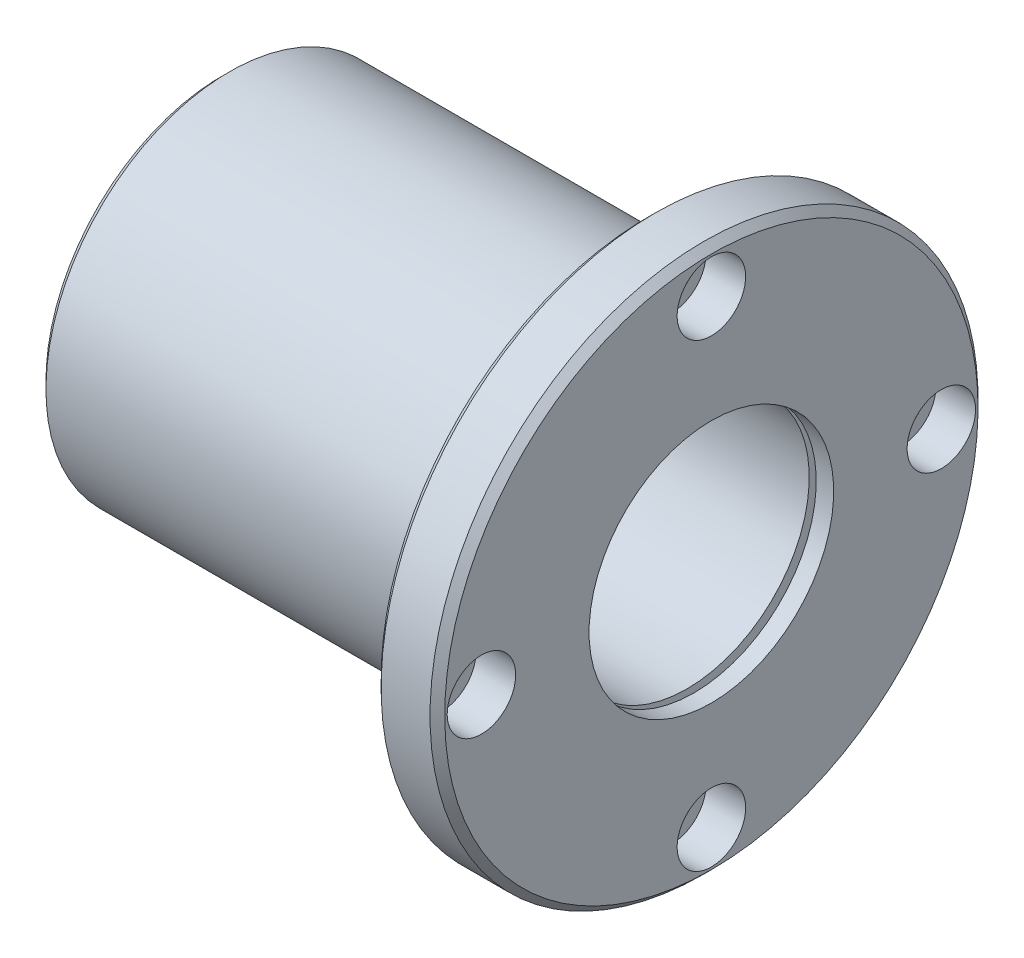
ISO-10303-21;
HEADER;
FILE_DESCRIPTION(('STEP AP214'),'2;1');
FILE_NAME('part.step','',(''),(''),'','','');
FILE_SCHEMA(('AUTOMOTIVE_DESIGN { 1 0 10303 214 1 1 1 1 }'));
ENDSEC;
DATA;
#1=APPLICATION_CONTEXT('core data for automotive mechanical design processes');
#2=APPLICATION_PROTOCOL_DEFINITION('international standard','automotive_design',2000,#1);
#3=PRODUCT_CONTEXT('',#1,'mechanical');
#4=PRODUCT('Part','Part','',(#3));
#5=PRODUCT_RELATED_PRODUCT_CATEGORY('part','',(#4));
#6=PRODUCT_DEFINITION_FORMATION('','',#4);
#7=PRODUCT_DEFINITION_CONTEXT('part definition',#1,'design');
#8=PRODUCT_DEFINITION('design','',#6,#7);
#9=PRODUCT_DEFINITION_SHAPE('','',#8);
#10=(LENGTH_UNIT() NAMED_UNIT(*) SI_UNIT(.MILLI.,.METRE.));
#11=(NAMED_UNIT(*) PLANE_ANGLE_UNIT() SI_UNIT($,.RADIAN.));
#12=(NAMED_UNIT(*) SI_UNIT($,.STERADIAN.) SOLID_ANGLE_UNIT());
#13=UNCERTAINTY_MEASURE_WITH_UNIT(LENGTH_MEASURE(1.E-05),#10,'distance_accuracy_value','');
#14=(GEOMETRIC_REPRESENTATION_CONTEXT(3) GLOBAL_UNCERTAINTY_ASSIGNED_CONTEXT((#13)) GLOBAL_UNIT_ASSIGNED_CONTEXT((#10,
#11,#12)) REPRESENTATION_CONTEXT('',''));
#15=CARTESIAN_POINT('',(0.,0.,0.));
#16=DIRECTION('',(0.,0.,1.));
#17=DIRECTION('',(1.,0.,0.));
#18=AXIS2_PLACEMENT_3D('',#15,#16,#17);
#19=CARTESIAN_POINT('',(0.,31.125,0.));
#20=DIRECTION('',(-1.,0.,0.));
#21=DIRECTION('',(0.,0.,1.));
#22=AXIS2_PLACEMENT_3D('',#19,#20,#21);
#23=PLANE('',#22);
#24=CARTESIAN_POINT('',(0.,0.,0.));
#25=DIRECTION('',(-1.,0.,0.));
#26=DIRECTION('',(0.,1.,0.));
#27=AXIS2_PLACEMENT_3D('',#24,#25,#26);
#28=CIRCLE('',#27,26.25);
#29=CARTESIAN_POINT('',(0.,-26.25,0.));
#30=VERTEX_POINT('',#29);
#31=EDGE_CURVE('E322',#30,#30,#28,.T.);
#32=ORIENTED_EDGE('',*,*,#31,.F.);
#33=EDGE_LOOP('',(#32));
#34=FACE_BOUND('',#33,.T.);
#35=CARTESIAN_POINT('',(0.,0.,0.));
#36=DIRECTION('',(-1.,0.,0.));
#37=DIRECTION('',(0.,1.,0.));
#38=AXIS2_PLACEMENT_3D('',#35,#36,#37);
#39=CIRCLE('',#38,36.);
#40=CARTESIAN_POINT('',(0.,-36.,0.));
#41=VERTEX_POINT('',#40);
#42=EDGE_CURVE('E211',#41,#41,#39,.T.);
#43=ORIENTED_EDGE('',*,*,#42,.T.);
#44=EDGE_LOOP('',(#43));
#45=FACE_BOUND('',#44,.T.);
#46=ADVANCED_FACE('F16',(#34,#45),#23,.T.);
#47=CARTESIAN_POINT('',(87.,45.8698114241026,0.));
#48=DIRECTION('',(-1.,0.,0.));
#49=DIRECTION('',(0.,0.,1.));
#50=AXIS2_PLACEMENT_3D('',#47,#48,#49);
#51=PLANE('',#50);
#52=CARTESIAN_POINT('',(87.,0.,0.));
#53=DIRECTION('',(-1.,0.,0.));
#54=DIRECTION('',(0.,1.,0.));
#55=AXIS2_PLACEMENT_3D('',#52,#53,#54);
#56=CIRCLE('',#55,37.2396228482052);
#57=CARTESIAN_POINT('',(87.,37.2396228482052,0.));
#58=VERTEX_POINT('',#57);
#59=CARTESIAN_POINT('',(87.,0.,-37.2396228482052));
#60=VERTEX_POINT('',#59);
#61=EDGE_CURVE('E221',#58,#60,#56,.T.);
#62=ORIENTED_EDGE('',*,*,#61,.F.);
#63=CARTESIAN_POINT('',(87.,0.,0.));
#64=DIRECTION('',(-1.,0.,0.));
#65=DIRECTION('',(0.,1.,0.));
#66=AXIS2_PLACEMENT_3D('',#63,#64,#65);
#67=CIRCLE('',#66,37.2396228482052);
#68=EDGE_CURVE('E216',#60,#58,#67,.T.);
#69=ORIENTED_EDGE('',*,*,#68,.F.);
#70=EDGE_LOOP('',(#62,#69));
#71=FACE_BOUND('',#70,.T.);
#72=CARTESIAN_POINT('',(87.,47.,0.));
#73=DIRECTION('',(1.,0.,0.));
#74=DIRECTION('',(0.,1.,0.));
#75=AXIS2_PLACEMENT_3D('',#72,#73,#74);
#76=CIRCLE('',#75,4.5);
#77=CARTESIAN_POINT('',(87.,42.5,0.));
#78=VERTEX_POINT('',#77);
#79=EDGE_CURVE('E337',#78,#78,#76,.T.);
#80=ORIENTED_EDGE('',*,*,#79,.T.);
#81=EDGE_LOOP('',(#80));
#82=FACE_BOUND('',#81,.T.);
#83=CARTESIAN_POINT('',(87.,-47.,0.));
#84=DIRECTION('',(1.,0.,0.));
#85=DIRECTION('',(0.,1.,0.));
#86=AXIS2_PLACEMENT_3D('',#83,#84,#85);
#87=CIRCLE('',#86,4.5);
#88=CARTESIAN_POINT('',(87.,-51.5,0.));
#89=VERTEX_POINT('',#88);
#90=EDGE_CURVE('E349',#89,#89,#87,.T.);
#91=ORIENTED_EDGE('',*,*,#90,.T.);
#92=EDGE_LOOP('',(#91));
#93=FACE_BOUND('',#92,.T.);
#94=CARTESIAN_POINT('',(87.,0.,47.));
#95=DIRECTION('',(1.,0.,0.));
#96=DIRECTION('',(0.,0.,-1.));
#97=AXIS2_PLACEMENT_3D('',#94,#95,#96);
#98=CIRCLE('',#97,4.5);
#99=CARTESIAN_POINT('',(87.,0.,51.5));
#100=VERTEX_POINT('',#99);
#101=EDGE_CURVE('E371',#100,#100,#98,.T.);
#102=ORIENTED_EDGE('',*,*,#101,.T.);
#103=EDGE_LOOP('',(#102));
#104=FACE_BOUND('',#103,.T.);
#105=CARTESIAN_POINT('',(87.,0.,-47.));
#106=DIRECTION('',(1.,0.,0.));
#107=DIRECTION('',(0.,0.,-1.));
#108=AXIS2_PLACEMENT_3D('',#105,#106,#107);
#109=CIRCLE('',#108,4.5);
#110=CARTESIAN_POINT('',(87.,0.,-42.5));
#111=VERTEX_POINT('',#110);
#112=EDGE_CURVE('E243',#111,#111,#109,.T.);
#113=ORIENTED_EDGE('',*,*,#112,.T.);
#114=EDGE_LOOP('',(#113));
#115=FACE_BOUND('',#114,.T.);
#116=CARTESIAN_POINT('',(87.,0.,0.));
#117=DIRECTION('',(-1.,0.,0.));
#118=DIRECTION('',(0.,1.,0.));
#119=AXIS2_PLACEMENT_3D('',#116,#117,#118);
#120=CIRCLE('',#119,54.5);
#121=CARTESIAN_POINT('',(87.,-54.5,0.));
#122=VERTEX_POINT('',#121);
#123=EDGE_CURVE('E225',#122,#122,#120,.T.);
#124=ORIENTED_EDGE('',*,*,#123,.T.);
#125=EDGE_LOOP('',(#124));
#126=FACE_BOUND('',#125,.T.);
#127=ADVANCED_FACE('F414',(#71,#82,#93,#104,#115,#126),#51,.T.);
#128=CARTESIAN_POINT('',(100.,39.75,0.));
#129=DIRECTION('',(1.,0.,0.));
#130=DIRECTION('',(0.,1.,0.));
#131=AXIS2_PLACEMENT_3D('',#128,#129,#130);
#132=PLANE('',#131);
#133=CARTESIAN_POINT('',(100.,47.,0.));
#134=DIRECTION('',(-1.,0.,0.));
#135=DIRECTION('',(0.,1.,0.));
#136=AXIS2_PLACEMENT_3D('',#133,#134,#135);
#137=CIRCLE('',#136,7.);
#138=CARTESIAN_POINT('',(100.,40.,0.));
#139=VERTEX_POINT('',#138);
#140=EDGE_CURVE('E265',#139,#139,#137,.T.);
#141=ORIENTED_EDGE('',*,*,#140,.T.);
#142=EDGE_LOOP('',(#141));
#143=FACE_BOUND('',#142,.T.);
#144=CARTESIAN_POINT('',(100.,-47.,0.));
#145=DIRECTION('',(-1.,0.,0.));
#146=DIRECTION('',(0.,1.,0.));
#147=AXIS2_PLACEMENT_3D('',#144,#145,#146);
#148=CIRCLE('',#147,7.);
#149=CARTESIAN_POINT('',(100.,-54.,0.));
#150=VERTEX_POINT('',#149);
#151=EDGE_CURVE('E368',#150,#150,#148,.T.);
#152=ORIENTED_EDGE('',*,*,#151,.T.);
#153=EDGE_LOOP('',(#152));
#154=FACE_BOUND('',#153,.T.);
#155=CARTESIAN_POINT('',(100.,0.,47.));
#156=DIRECTION('',(-1.,0.,0.));
#157=DIRECTION('',(0.,0.,-1.));
#158=AXIS2_PLACEMENT_3D('',#155,#156,#157);
#159=CIRCLE('',#158,7.);
#160=CARTESIAN_POINT('',(100.,0.,54.));
#161=VERTEX_POINT('',#160);
#162=EDGE_CURVE('E381',#161,#161,#159,.T.);
#163=ORIENTED_EDGE('',*,*,#162,.T.);
#164=EDGE_LOOP('',(#163));
#165=FACE_BOUND('',#164,.T.);
#166=CARTESIAN_POINT('',(100.,0.,-47.));
#167=DIRECTION('',(-1.,0.,0.));
#168=DIRECTION('',(0.,0.,-1.));
#169=AXIS2_PLACEMENT_3D('',#166,#167,#168);
#170=CIRCLE('',#169,7.);
#171=CARTESIAN_POINT('',(100.,0.,-40.));
#172=VERTEX_POINT('',#171);
#173=EDGE_CURVE('E10',#172,#172,#170,.T.);
#174=ORIENTED_EDGE('',*,*,#173,.T.);
#175=EDGE_LOOP('',(#174));
#176=FACE_BOUND('',#175,.T.);
#177=CARTESIAN_POINT('',(100.,0.,0.));
#178=DIRECTION('',(-1.,0.,0.));
#179=DIRECTION('',(0.,1.,0.));
#180=AXIS2_PLACEMENT_3D('',#177,#178,#179);
#181=CIRCLE('',#180,25.);
#182=CARTESIAN_POINT('',(100.,-25.,0.));
#183=VERTEX_POINT('',#182);
#184=EDGE_CURVE('E282',#183,#183,#181,.T.);
#185=ORIENTED_EDGE('',*,*,#184,.T.);
#186=EDGE_LOOP('',(#185));
#187=FACE_BOUND('',#186,.T.);
#188=CARTESIAN_POINT('',(100.,0.,0.));
#189=DIRECTION('',(-1.,0.,0.));
#190=DIRECTION('',(0.,1.,0.));
#191=AXIS2_PLACEMENT_3D('',#188,#189,#190);
#192=CIRCLE('',#191,54.5);
#193=CARTESIAN_POINT('',(100.,-54.5,0.));
#194=VERTEX_POINT('',#193);
#195=EDGE_CURVE('E260',#194,#194,#192,.T.);
#196=ORIENTED_EDGE('',*,*,#195,.F.);
#197=EDGE_LOOP('',(#196));
#198=FACE_BOUND('',#197,.T.);
#199=ADVANCED_FACE('F419',(#143,#154,#165,#176,#187,#198),#132,.T.);
#200=CARTESIAN_POINT('',(96.4285714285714,26.875,0.));
#201=DIRECTION('',(-1.,0.,0.));
#202=DIRECTION('',(0.,0.,1.));
#203=AXIS2_PLACEMENT_3D('',#200,#201,#202);
#204=PLANE('',#203);
#205=CARTESIAN_POINT('',(96.4285714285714,0.,0.));
#206=DIRECTION('',(-1.,0.,0.));
#207=DIRECTION('',(0.,1.,0.));
#208=AXIS2_PLACEMENT_3D('',#205,#206,#207);
#209=CIRCLE('',#208,25.);
#210=CARTESIAN_POINT('',(96.4285714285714,-25.,0.));
#211=VERTEX_POINT('',#210);
#212=EDGE_CURVE('E269',#211,#211,#209,.T.);
#213=ORIENTED_EDGE('',*,*,#212,.F.);
#214=EDGE_LOOP('',(#213));
#215=FACE_BOUND('',#214,.T.);
#216=CARTESIAN_POINT('',(96.4285714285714,0.,0.));
#217=DIRECTION('',(-1.,0.,0.));
#218=DIRECTION('',(0.,1.,0.));
#219=AXIS2_PLACEMENT_3D('',#216,#217,#218);
#220=CIRCLE('',#219,28.75);
#221=CARTESIAN_POINT('',(96.4285714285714,-28.75,0.));
#222=VERTEX_POINT('',#221);
#223=EDGE_CURVE('E293',#222,#222,#220,.T.);
#224=ORIENTED_EDGE('',*,*,#223,.T.);
#225=EDGE_LOOP('',(#224));
#226=FACE_BOUND('',#225,.T.);
#227=ADVANCED_FACE('F895',(#215,#226),#204,.T.);
#228=CARTESIAN_POINT('',(95.,26.875,0.));
#229=DIRECTION('',(1.,0.,0.));
#230=DIRECTION('',(0.,1.,0.));
#231=AXIS2_PLACEMENT_3D('',#228,#229,#230);
#232=PLANE('',#231);
#233=CARTESIAN_POINT('',(95.,0.,0.));
#234=DIRECTION('',(-1.,0.,0.));
#235=DIRECTION('',(0.,1.,0.));
#236=AXIS2_PLACEMENT_3D('',#233,#234,#235);
#237=CIRCLE('',#236,25.);
#238=CARTESIAN_POINT('',(95.,-25.,0.));
#239=VERTEX_POINT('',#238);
#240=EDGE_CURVE('E308',#239,#239,#237,.T.);
#241=ORIENTED_EDGE('',*,*,#240,.T.);
#242=EDGE_LOOP('',(#241));
#243=FACE_BOUND('',#242,.T.);
#244=CARTESIAN_POINT('',(95.,0.,0.));
#245=DIRECTION('',(-1.,0.,0.));
#246=DIRECTION('',(0.,1.,0.));
#247=AXIS2_PLACEMENT_3D('',#244,#245,#246);
#248=CIRCLE('',#247,28.75);
#249=CARTESIAN_POINT('',(95.,-28.75,0.));
#250=VERTEX_POINT('',#249);
#251=EDGE_CURVE('E285',#250,#250,#248,.T.);
#252=ORIENTED_EDGE('',*,*,#251,.F.);
#253=EDGE_LOOP('',(#252));
#254=FACE_BOUND('',#253,.T.);
#255=ADVANCED_FACE('F883',(#243,#254),#232,.T.);
#256=CARTESIAN_POINT('',(5.,26.875,0.));
#257=DIRECTION('',(-1.,0.,0.));
#258=DIRECTION('',(0.,0.,1.));
#259=AXIS2_PLACEMENT_3D('',#256,#257,#258);
#260=PLANE('',#259);
#261=CARTESIAN_POINT('',(5.,0.,0.));
#262=DIRECTION('',(-1.,0.,0.));
#263=DIRECTION('',(0.,1.,0.));
#264=AXIS2_PLACEMENT_3D('',#261,#262,#263);
#265=CIRCLE('',#264,25.);
#266=CARTESIAN_POINT('',(5.,-25.,0.));
#267=VERTEX_POINT('',#266);
#268=EDGE_CURVE('E300',#267,#267,#265,.T.);
#269=ORIENTED_EDGE('',*,*,#268,.F.);
#270=EDGE_LOOP('',(#269));
#271=FACE_BOUND('',#270,.T.);
#272=CARTESIAN_POINT('',(5.,0.,0.));
#273=DIRECTION('',(-1.,0.,0.));
#274=DIRECTION('',(0.,1.,0.));
#275=AXIS2_PLACEMENT_3D('',#272,#273,#274);
#276=CIRCLE('',#275,28.75);
#277=CARTESIAN_POINT('',(5.,-28.75,0.));
#278=VERTEX_POINT('',#277);
#279=EDGE_CURVE('E319',#278,#278,#276,.T.);
#280=ORIENTED_EDGE('',*,*,#279,.T.);
#281=EDGE_LOOP('',(#280));
#282=FACE_BOUND('',#281,.T.);
#283=ADVANCED_FACE('F871',(#271,#282),#260,.T.);
#284=CARTESIAN_POINT('',(3.57142857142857,27.5,0.));
#285=DIRECTION('',(1.,0.,0.));
#286=DIRECTION('',(0.,-1.,0.));
#287=AXIS2_PLACEMENT_3D('',#284,#285,#286);
#288=PLANE('',#287);
#289=CARTESIAN_POINT('',(3.57142857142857,0.,0.));
#290=DIRECTION('',(-1.,0.,0.));
#291=DIRECTION('',(0.,1.,0.));
#292=AXIS2_PLACEMENT_3D('',#289,#290,#291);
#293=CIRCLE('',#292,26.25);
#294=CARTESIAN_POINT('',(3.57142857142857,-26.25,0.));
#295=VERTEX_POINT('',#294);
#296=EDGE_CURVE('E330',#295,#295,#293,.T.);
#297=ORIENTED_EDGE('',*,*,#296,.T.);
#298=EDGE_LOOP('',(#297));
#299=FACE_BOUND('',#298,.T.);
#300=CARTESIAN_POINT('',(3.57142857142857,0.,0.));
#301=DIRECTION('',(-1.,0.,0.));
#302=DIRECTION('',(0.,1.,0.));
#303=AXIS2_PLACEMENT_3D('',#300,#301,#302);
#304=CIRCLE('',#303,28.75);
#305=CARTESIAN_POINT('',(3.57142857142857,-28.75,0.));
#306=VERTEX_POINT('',#305);
#307=EDGE_CURVE('E311',#306,#306,#304,.T.);
#308=ORIENTED_EDGE('',*,*,#307,.F.);
#309=EDGE_LOOP('',(#308));
#310=FACE_BOUND('',#309,.T.);
#311=ADVANCED_FACE('F859',(#299,#310),#288,.T.);
#312=CARTESIAN_POINT('',(91.9,52.75,0.));
#313=DIRECTION('',(-1.,0.,0.));
#314=DIRECTION('',(0.,0.,1.));
#315=AXIS2_PLACEMENT_3D('',#312,#313,#314);
#316=PLANE('',#315);
#317=CARTESIAN_POINT('',(91.9,47.,0.));
#318=DIRECTION('',(-1.,0.,0.));
#319=DIRECTION('',(0.,1.,0.));
#320=AXIS2_PLACEMENT_3D('',#317,#318,#319);
#321=CIRCLE('',#320,4.5);
#322=CARTESIAN_POINT('',(91.9,42.5,0.));
#323=VERTEX_POINT('',#322);
#324=EDGE_CURVE('E331',#323,#323,#321,.T.);
#325=ORIENTED_EDGE('',*,*,#324,.T.);
#326=EDGE_LOOP('',(#325));
#327=FACE_BOUND('',#326,.T.);
#328=CARTESIAN_POINT('',(91.9,47.,0.));
#329=DIRECTION('',(-1.,0.,0.));
#330=DIRECTION('',(0.,1.,0.));
#331=AXIS2_PLACEMENT_3D('',#328,#329,#330);
#332=CIRCLE('',#331,7.);
#333=CARTESIAN_POINT('',(91.9,40.,0.));
#334=VERTEX_POINT('',#333);
#335=EDGE_CURVE('E266',#334,#334,#332,.T.);
#336=ORIENTED_EDGE('',*,*,#335,.F.);
#337=EDGE_LOOP('',(#336));
#338=FACE_BOUND('',#337,.T.);
#339=ADVANCED_FACE('F632',(#327,#338),#316,.F.);
#340=CARTESIAN_POINT('',(91.9,-41.25,0.));
#341=DIRECTION('',(-1.,0.,0.));
#342=DIRECTION('',(0.,0.,1.));
#343=AXIS2_PLACEMENT_3D('',#340,#341,#342);
#344=PLANE('',#343);
#345=CARTESIAN_POINT('',(91.9,-47.,0.));
#346=DIRECTION('',(-1.,0.,0.));
#347=DIRECTION('',(0.,1.,0.));
#348=AXIS2_PLACEMENT_3D('',#345,#346,#347);
#349=CIRCLE('',#348,4.5);
#350=CARTESIAN_POINT('',(91.9,-51.5,0.));
#351=VERTEX_POINT('',#350);
#352=EDGE_CURVE('E357',#351,#351,#349,.T.);
#353=ORIENTED_EDGE('',*,*,#352,.T.);
#354=EDGE_LOOP('',(#353));
#355=FACE_BOUND('',#354,.T.);
#356=CARTESIAN_POINT('',(91.9,-47.,0.));
#357=DIRECTION('',(-1.,0.,0.));
#358=DIRECTION('',(0.,1.,0.));
#359=AXIS2_PLACEMENT_3D('',#356,#357,#358);
#360=CIRCLE('',#359,7.);
#361=CARTESIAN_POINT('',(91.9,-54.,0.));
#362=VERTEX_POINT('',#361);
#363=EDGE_CURVE('E360',#362,#362,#360,.T.);
#364=ORIENTED_EDGE('',*,*,#363,.F.);
#365=EDGE_LOOP('',(#364));
#366=FACE_BOUND('',#365,.T.);
#367=ADVANCED_FACE('F410',(#355,#366),#344,.F.);
#368=CARTESIAN_POINT('',(91.9,0.,41.25));
#369=DIRECTION('',(-1.,0.,0.));
#370=DIRECTION('',(0.,0.,1.));
#371=AXIS2_PLACEMENT_3D('',#368,#369,#370);
#372=PLANE('',#371);
#373=CARTESIAN_POINT('',(91.9,0.,47.));
#374=DIRECTION('',(-1.,0.,0.));
#375=DIRECTION('',(0.,0.,-1.));
#376=AXIS2_PLACEMENT_3D('',#373,#374,#375);
#377=CIRCLE('',#376,4.5);
#378=CARTESIAN_POINT('',(91.9,0.,51.5));
#379=VERTEX_POINT('',#378);
#380=EDGE_CURVE('E274',#379,#379,#377,.T.);
#381=ORIENTED_EDGE('',*,*,#380,.T.);
#382=EDGE_LOOP('',(#381));
#383=FACE_BOUND('',#382,.T.);
#384=CARTESIAN_POINT('',(91.9,0.,47.));
#385=DIRECTION('',(-1.,0.,0.));
#386=DIRECTION('',(0.,0.,-1.));
#387=AXIS2_PLACEMENT_3D('',#384,#385,#386);
#388=CIRCLE('',#387,7.);
#389=CARTESIAN_POINT('',(91.9,0.,54.));
#390=VERTEX_POINT('',#389);
#391=EDGE_CURVE('E277',#390,#390,#388,.T.);
#392=ORIENTED_EDGE('',*,*,#391,.F.);
#393=EDGE_LOOP('',(#392));
#394=FACE_BOUND('',#393,.T.);
#395=ADVANCED_FACE('F400',(#383,#394),#372,.F.);
#396=CARTESIAN_POINT('',(91.9,0.,-52.75));
#397=DIRECTION('',(-1.,0.,0.));
#398=DIRECTION('',(0.,0.,1.));
#399=AXIS2_PLACEMENT_3D('',#396,#397,#398);
#400=PLANE('',#399);
#401=CARTESIAN_POINT('',(91.9,0.,-47.));
#402=DIRECTION('',(-1.,0.,0.));
#403=DIRECTION('',(0.,0.,-1.));
#404=AXIS2_PLACEMENT_3D('',#401,#402,#403);
#405=CIRCLE('',#404,4.5);
#406=CARTESIAN_POINT('',(91.9,0.,-42.5));
#407=VERTEX_POINT('',#406);
#408=EDGE_CURVE('E242',#407,#407,#405,.T.);
#409=ORIENTED_EDGE('',*,*,#408,.T.);
#410=EDGE_LOOP('',(#409));
#411=FACE_BOUND('',#410,.T.);
#412=CARTESIAN_POINT('',(91.9,0.,-47.));
#413=DIRECTION('',(-1.,0.,0.));
#414=DIRECTION('',(0.,0.,-1.));
#415=AXIS2_PLACEMENT_3D('',#412,#413,#414);
#416=CIRCLE('',#415,7.);
#417=CARTESIAN_POINT('',(91.9,0.,-40.));
#418=VERTEX_POINT('',#417);
#419=EDGE_CURVE('E388',#418,#418,#416,.T.);
#420=ORIENTED_EDGE('',*,*,#419,.F.);
#421=EDGE_LOOP('',(#420));
#422=FACE_BOUND('',#421,.T.);
#423=ADVANCED_FACE('F398',(#411,#422),#400,.F.);
#424=CARTESIAN_POINT('',(95.95,0.,-47.));
#425=DIRECTION('',(1.,0.,0.));
#426=DIRECTION('',(0.,0.,-1.));
#427=AXIS2_PLACEMENT_3D('',#424,#425,#426);
#428=CYLINDRICAL_SURFACE('',#427,7.);
#429=ORIENTED_EDGE('',*,*,#419,.T.);
#430=DIRECTION('',(1.,0.,0.));
#431=VECTOR('',#430,1.);
#432=CARTESIAN_POINT('',(95.95,0.,-40.));
#433=LINE('',#432,#431);
#434=EDGE_CURVE('E24',#418,#172,#433,.T.);
#435=ORIENTED_EDGE('',*,*,#434,.T.);
#436=ORIENTED_EDGE('',*,*,#173,.F.);
#437=ORIENTED_EDGE('',*,*,#434,.F.);
#438=EDGE_LOOP('',(#429,#435,#436,#437));
#439=FACE_BOUND('',#438,.T.);
#440=ADVANCED_FACE('F396',(#439),#428,.F.);
#441=CARTESIAN_POINT('',(89.45,0.,-47.));
#442=DIRECTION('',(1.,0.,0.));
#443=DIRECTION('',(0.,0.,-1.));
#444=AXIS2_PLACEMENT_3D('',#441,#442,#443);
#445=CYLINDRICAL_SURFACE('',#444,4.5);
#446=ORIENTED_EDGE('',*,*,#112,.F.);
#447=DIRECTION('',(1.,0.,0.));
#448=VECTOR('',#447,1.);
#449=CARTESIAN_POINT('',(89.45,0.,-42.5));
#450=LINE('',#449,#448);
#451=EDGE_CURVE('E238',#111,#407,#450,.T.);
#452=ORIENTED_EDGE('',*,*,#451,.T.);
#453=ORIENTED_EDGE('',*,*,#408,.F.);
#454=ORIENTED_EDGE('',*,*,#451,.F.);
#455=EDGE_LOOP('',(#446,#452,#453,#454));
#456=FACE_BOUND('',#455,.T.);
#457=ADVANCED_FACE('F408',(#456),#445,.F.);
#458=CARTESIAN_POINT('',(95.95,0.,47.));
#459=DIRECTION('',(1.,0.,0.));
#460=DIRECTION('',(0.,0.,-1.));
#461=AXIS2_PLACEMENT_3D('',#458,#459,#460);
#462=CYLINDRICAL_SURFACE('',#461,7.);
#463=ORIENTED_EDGE('',*,*,#391,.T.);
#464=DIRECTION('',(1.,0.,0.));
#465=VECTOR('',#464,1.);
#466=CARTESIAN_POINT('',(95.95,0.,54.));
#467=LINE('',#466,#465);
#468=EDGE_CURVE('E297',#390,#161,#467,.T.);
#469=ORIENTED_EDGE('',*,*,#468,.T.);
#470=ORIENTED_EDGE('',*,*,#162,.F.);
#471=ORIENTED_EDGE('',*,*,#468,.F.);
#472=EDGE_LOOP('',(#463,#469,#470,#471));
#473=FACE_BOUND('',#472,.T.);
#474=ADVANCED_FACE('F804',(#473),#462,.F.);
#475=CARTESIAN_POINT('',(89.45,0.,47.));
#476=DIRECTION('',(1.,0.,0.));
#477=DIRECTION('',(0.,0.,-1.));
#478=AXIS2_PLACEMENT_3D('',#475,#476,#477);
#479=CYLINDRICAL_SURFACE('',#478,4.5);
#480=ORIENTED_EDGE('',*,*,#101,.F.);
#481=DIRECTION('',(1.,0.,0.));
#482=VECTOR('',#481,1.);
#483=CARTESIAN_POINT('',(89.45,0.,51.5));
#484=LINE('',#483,#482);
#485=EDGE_CURVE('E278',#100,#379,#484,.T.);
#486=ORIENTED_EDGE('',*,*,#485,.T.);
#487=ORIENTED_EDGE('',*,*,#380,.F.);
#488=ORIENTED_EDGE('',*,*,#485,.F.);
#489=EDGE_LOOP('',(#480,#486,#487,#488));
#490=FACE_BOUND('',#489,.T.);
#491=ADVANCED_FACE('F606',(#490),#479,.F.);
#492=CARTESIAN_POINT('',(95.95,-47.,0.));
#493=DIRECTION('',(1.,0.,0.));
#494=DIRECTION('',(0.,1.,0.));
#495=AXIS2_PLACEMENT_3D('',#492,#493,#494);
#496=CYLINDRICAL_SURFACE('',#495,7.);
#497=ORIENTED_EDGE('',*,*,#363,.T.);
#498=DIRECTION('',(1.,0.,0.));
#499=VECTOR('',#498,1.);
#500=CARTESIAN_POINT('',(95.95,-54.,0.));
#501=LINE('',#500,#499);
#502=EDGE_CURVE('E364',#362,#150,#501,.T.);
#503=ORIENTED_EDGE('',*,*,#502,.T.);
#504=ORIENTED_EDGE('',*,*,#151,.F.);
#505=ORIENTED_EDGE('',*,*,#502,.F.);
#506=EDGE_LOOP('',(#497,#503,#504,#505));
#507=FACE_BOUND('',#506,.T.);
#508=ADVANCED_FACE('F599',(#507),#496,.F.);
#509=CARTESIAN_POINT('',(89.45,-47.,0.));
#510=DIRECTION('',(1.,0.,0.));
#511=DIRECTION('',(0.,1.,0.));
#512=AXIS2_PLACEMENT_3D('',#509,#510,#511);
#513=CYLINDRICAL_SURFACE('',#512,4.5);
#514=ORIENTED_EDGE('',*,*,#90,.F.);
#515=DIRECTION('',(1.,0.,0.));
#516=VECTOR('',#515,1.);
#517=CARTESIAN_POINT('',(89.45,-51.5,0.));
#518=LINE('',#517,#516);
#519=EDGE_CURVE('E353',#89,#351,#518,.T.);
#520=ORIENTED_EDGE('',*,*,#519,.T.);
#521=ORIENTED_EDGE('',*,*,#352,.F.);
#522=ORIENTED_EDGE('',*,*,#519,.F.);
#523=EDGE_LOOP('',(#514,#520,#521,#522));
#524=FACE_BOUND('',#523,.T.);
#525=ADVANCED_FACE('F605',(#524),#513,.F.);
#526=CARTESIAN_POINT('',(95.95,47.,0.));
#527=DIRECTION('',(1.,0.,0.));
#528=DIRECTION('',(0.,1.,0.));
#529=AXIS2_PLACEMENT_3D('',#526,#527,#528);
#530=CYLINDRICAL_SURFACE('',#529,7.);
#531=ORIENTED_EDGE('',*,*,#335,.T.);
#532=DIRECTION('',(1.,0.,0.));
#533=VECTOR('',#532,1.);
#534=CARTESIAN_POINT('',(95.95,40.,0.));
#535=LINE('',#534,#533);
#536=EDGE_CURVE('E261',#334,#139,#535,.T.);
#537=ORIENTED_EDGE('',*,*,#536,.T.);
#538=ORIENTED_EDGE('',*,*,#140,.F.);
#539=ORIENTED_EDGE('',*,*,#536,.F.);
#540=EDGE_LOOP('',(#531,#537,#538,#539));
#541=FACE_BOUND('',#540,.T.);
#542=ADVANCED_FACE('F689',(#541),#530,.F.);
#543=CARTESIAN_POINT('',(89.45,47.,0.));
#544=DIRECTION('',(1.,0.,0.));
#545=DIRECTION('',(0.,1.,0.));
#546=AXIS2_PLACEMENT_3D('',#543,#544,#545);
#547=CYLINDRICAL_SURFACE('',#546,4.5);
#548=ORIENTED_EDGE('',*,*,#79,.F.);
#549=DIRECTION('',(1.,0.,0.));
#550=VECTOR('',#549,1.);
#551=CARTESIAN_POINT('',(89.45,42.5,0.));
#552=LINE('',#551,#550);
#553=EDGE_CURVE('E334',#78,#323,#552,.T.);
#554=ORIENTED_EDGE('',*,*,#553,.T.);
#555=ORIENTED_EDGE('',*,*,#324,.F.);
#556=ORIENTED_EDGE('',*,*,#553,.F.);
#557=EDGE_LOOP('',(#548,#554,#555,#556));
#558=FACE_BOUND('',#557,.T.);
#559=ADVANCED_FACE('F694',(#558),#547,.F.);
#560=CARTESIAN_POINT('',(1.78571428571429,0.,0.));
#561=DIRECTION('',(1.,0.,0.));
#562=DIRECTION('',(0.,1.,0.));
#563=AXIS2_PLACEMENT_3D('',#560,#561,#562);
#564=CYLINDRICAL_SURFACE('',#563,26.25);
#565=ORIENTED_EDGE('',*,*,#31,.T.);
#566=DIRECTION('',(1.,0.,0.));
#567=VECTOR('',#566,1.);
#568=CARTESIAN_POINT('',(1.78571428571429,-26.25,0.));
#569=LINE('',#568,#567);
#570=EDGE_CURVE('E326',#30,#295,#569,.T.);
#571=ORIENTED_EDGE('',*,*,#570,.T.);
#572=ORIENTED_EDGE('',*,*,#296,.F.);
#573=ORIENTED_EDGE('',*,*,#570,.F.);
#574=EDGE_LOOP('',(#565,#571,#572,#573));
#575=FACE_BOUND('',#574,.T.);
#576=ADVANCED_FACE('F750',(#575),#564,.F.);
#577=CARTESIAN_POINT('',(4.28571428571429,0.,0.));
#578=DIRECTION('',(1.,0.,0.));
#579=DIRECTION('',(0.,1.,0.));
#580=AXIS2_PLACEMENT_3D('',#577,#578,#579);
#581=CYLINDRICAL_SURFACE('',#580,28.75);
#582=ORIENTED_EDGE('',*,*,#307,.T.);
#583=DIRECTION('',(1.,0.,0.));
#584=VECTOR('',#583,1.);
#585=CARTESIAN_POINT('',(4.28571428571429,-28.75,0.));
#586=LINE('',#585,#584);
#587=EDGE_CURVE('E315',#306,#278,#586,.T.);
#588=ORIENTED_EDGE('',*,*,#587,.T.);
#589=ORIENTED_EDGE('',*,*,#279,.F.);
#590=ORIENTED_EDGE('',*,*,#587,.F.);
#591=EDGE_LOOP('',(#582,#588,#589,#590));
#592=FACE_BOUND('',#591,.T.);
#593=ADVANCED_FACE('F762',(#592),#581,.F.);
#594=CARTESIAN_POINT('',(50.,0.,0.));
#595=DIRECTION('',(1.,0.,0.));
#596=DIRECTION('',(0.,1.,0.));
#597=AXIS2_PLACEMENT_3D('',#594,#595,#596);
#598=CYLINDRICAL_SURFACE('',#597,25.);
#599=ORIENTED_EDGE('',*,*,#268,.T.);
#600=DIRECTION('',(1.,0.,0.));
#601=VECTOR('',#600,1.);
#602=CARTESIAN_POINT('',(50.,-25.,0.));
#603=LINE('',#602,#601);
#604=EDGE_CURVE('E304',#267,#239,#603,.T.);
#605=ORIENTED_EDGE('',*,*,#604,.T.);
#606=ORIENTED_EDGE('',*,*,#240,.F.);
#607=ORIENTED_EDGE('',*,*,#604,.F.);
#608=EDGE_LOOP('',(#599,#605,#606,#607));
#609=FACE_BOUND('',#608,.T.);
#610=ADVANCED_FACE('F738',(#609),#598,.F.);
#611=CARTESIAN_POINT('',(95.7142857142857,0.,0.));
#612=DIRECTION('',(1.,0.,0.));
#613=DIRECTION('',(0.,1.,0.));
#614=AXIS2_PLACEMENT_3D('',#611,#612,#613);
#615=CYLINDRICAL_SURFACE('',#614,28.75);
#616=ORIENTED_EDGE('',*,*,#251,.T.);
#617=DIRECTION('',(1.,0.,0.));
#618=VECTOR('',#617,1.);
#619=CARTESIAN_POINT('',(95.7142857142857,-28.75,0.));
#620=LINE('',#619,#618);
#621=EDGE_CURVE('E289',#250,#222,#620,.T.);
#622=ORIENTED_EDGE('',*,*,#621,.T.);
#623=ORIENTED_EDGE('',*,*,#223,.F.);
#624=ORIENTED_EDGE('',*,*,#621,.F.);
#625=EDGE_LOOP('',(#616,#622,#623,#624));
#626=FACE_BOUND('',#625,.T.);
#627=ADVANCED_FACE('F726',(#626),#615,.F.);
#628=CARTESIAN_POINT('',(98.2142857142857,0.,0.));
#629=DIRECTION('',(1.,0.,0.));
#630=DIRECTION('',(0.,1.,0.));
#631=AXIS2_PLACEMENT_3D('',#628,#629,#630);
#632=CYLINDRICAL_SURFACE('',#631,25.);
#633=ORIENTED_EDGE('',*,*,#212,.T.);
#634=DIRECTION('',(1.,0.,0.));
#635=VECTOR('',#634,1.);
#636=CARTESIAN_POINT('',(98.2142857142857,-25.,0.));
#637=LINE('',#636,#635);
#638=EDGE_CURVE('E273',#211,#183,#637,.T.);
#639=ORIENTED_EDGE('',*,*,#638,.T.);
#640=ORIENTED_EDGE('',*,*,#184,.F.);
#641=ORIENTED_EDGE('',*,*,#638,.F.);
#642=EDGE_LOOP('',(#633,#639,#640,#641));
#643=FACE_BOUND('',#642,.T.);
#644=ADVANCED_FACE('F648',(#643),#632,.F.);
#645=CARTESIAN_POINT('',(99.25,0.,0.));
#646=DIRECTION('',(-1.,0.,0.));
#647=DIRECTION('',(0.,1.,0.));
#648=AXIS2_PLACEMENT_3D('',#645,#646,#647);
#649=CONICAL_SURFACE('',#648,55.25,0.785398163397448);
#650=CARTESIAN_POINT('',(98.5,0.,0.));
#651=DIRECTION('',(-1.,0.,0.));
#652=DIRECTION('',(0.,1.,0.));
#653=AXIS2_PLACEMENT_3D('',#650,#651,#652);
#654=CIRCLE('',#653,56.);
#655=CARTESIAN_POINT('',(98.5,-56.,0.));
#656=VERTEX_POINT('',#655);
#657=EDGE_CURVE('E228',#656,#656,#654,.T.);
#658=ORIENTED_EDGE('',*,*,#657,.F.);
#659=DIRECTION('',(0.707106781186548,0.707106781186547,0.));
#660=VECTOR('',#659,1.);
#661=CARTESIAN_POINT('',(99.25,-55.25,0.));
#662=LINE('',#661,#660);
#663=EDGE_CURVE('E256',#656,#194,#662,.T.);
#664=ORIENTED_EDGE('',*,*,#663,.T.);
#665=ORIENTED_EDGE('',*,*,#195,.T.);
#666=ORIENTED_EDGE('',*,*,#663,.F.);
#667=EDGE_LOOP('',(#658,#664,#665,#666));
#668=FACE_BOUND('',#667,.T.);
#669=ADVANCED_FACE('F642',(#668),#649,.T.);
#670=CARTESIAN_POINT('',(93.5,0.,0.));
#671=DIRECTION('',(1.,0.,0.));
#672=DIRECTION('',(0.,1.,0.));
#673=AXIS2_PLACEMENT_3D('',#670,#671,#672);
#674=CYLINDRICAL_SURFACE('',#673,56.);
#675=ORIENTED_EDGE('',*,*,#657,.T.);
#676=DIRECTION('',(-1.,0.,0.));
#677=VECTOR('',#676,1.);
#678=CARTESIAN_POINT('',(93.5,-56.,0.));
#679=LINE('',#678,#677);
#680=CARTESIAN_POINT('',(88.5,-56.,0.));
#681=VERTEX_POINT('',#680);
#682=EDGE_CURVE('E253',#656,#681,#679,.T.);
#683=ORIENTED_EDGE('',*,*,#682,.T.);
#684=CARTESIAN_POINT('',(88.5,0.,0.));
#685=DIRECTION('',(-1.,0.,0.));
#686=DIRECTION('',(0.,1.,0.));
#687=AXIS2_PLACEMENT_3D('',#684,#685,#686);
#688=CIRCLE('',#687,56.);
#689=EDGE_CURVE('E192',#681,#681,#688,.T.);
#690=ORIENTED_EDGE('',*,*,#689,.F.);
#691=ORIENTED_EDGE('',*,*,#682,.F.);
#692=EDGE_LOOP('',(#675,#683,#690,#691));
#693=FACE_BOUND('',#692,.T.);
#694=ADVANCED_FACE('F647',(#693),#674,.T.);
#695=CARTESIAN_POINT('',(87.75,0.,0.));
#696=DIRECTION('',(1.,0.,0.));
#697=DIRECTION('',(0.,1.,0.));
#698=AXIS2_PLACEMENT_3D('',#695,#696,#697);
#699=CONICAL_SURFACE('',#698,55.25,0.785398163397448);
#700=ORIENTED_EDGE('',*,*,#689,.T.);
#701=DIRECTION('',(-0.707106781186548,0.707106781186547,0.));
#702=VECTOR('',#701,1.);
#703=CARTESIAN_POINT('',(87.75,-55.25,0.));
#704=LINE('',#703,#702);
#705=EDGE_CURVE('E229',#681,#122,#704,.T.);
#706=ORIENTED_EDGE('',*,*,#705,.T.);
#707=ORIENTED_EDGE('',*,*,#123,.F.);
#708=ORIENTED_EDGE('',*,*,#705,.F.);
#709=EDGE_LOOP('',(#700,#706,#707,#708));
#710=FACE_BOUND('',#709,.T.);
#711=ADVANCED_FACE('F681',(#710),#699,.T.);
#712=CARTESIAN_POINT('',(84.6725855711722,0.,0.));
#713=DIRECTION('',(-1.,0.,0.));
#714=DIRECTION('',(0.,1.,0.));
#715=AXIS2_PLACEMENT_3D('',#712,#713,#714);
#716=CONICAL_SURFACE('',#715,37.0799718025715,0.261001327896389);
#717=CARTESIAN_POINT('',(83.1,0.,0.));
#718=DIRECTION('',(-1.,0.,0.));
#719=DIRECTION('',(0.,1.,0.));
#720=AXIS2_PLACEMENT_3D('',#717,#718,#719);
#721=CIRCLE('',#720,37.5);
#722=CARTESIAN_POINT('',(83.1,-37.5,0.));
#723=VERTEX_POINT('',#722);
#724=EDGE_CURVE('E189',#723,#723,#721,.T.);
#725=ORIENTED_EDGE('',*,*,#724,.F.);
#726=DIRECTION('',(0.966132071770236,0.258048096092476,0.));
#727=VECTOR('',#726,1.);
#728=CARTESIAN_POINT('',(84.6725855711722,-37.0799718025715,0.));
#729=LINE('',#728,#727);
#730=CARTESIAN_POINT('',(86.2451711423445,-36.659943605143,0.));
#731=VERTEX_POINT('',#730);
#732=EDGE_CURVE('E183',#723,#731,#729,.T.);
#733=ORIENTED_EDGE('',*,*,#732,.T.);
#734=CARTESIAN_POINT('',(86.2451711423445,0.,0.));
#735=DIRECTION('',(-1.,0.,0.));
#736=DIRECTION('',(0.,1.,0.));
#737=AXIS2_PLACEMENT_3D('',#734,#735,#736);
#738=CIRCLE('',#737,36.659943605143);
#739=CARTESIAN_POINT('',(86.2451711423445,0.,-36.659943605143));
#740=VERTEX_POINT('',#739);
#741=EDGE_CURVE('E187',#731,#740,#738,.T.);
#742=ORIENTED_EDGE('',*,*,#741,.T.);
#743=CARTESIAN_POINT('',(86.2451711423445,0.,0.));
#744=DIRECTION('',(-1.,0.,0.));
#745=DIRECTION('',(0.,1.,0.));
#746=AXIS2_PLACEMENT_3D('',#743,#744,#745);
#747=CIRCLE('',#746,36.659943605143);
#748=EDGE_CURVE('E196',#740,#731,#747,.T.);
#749=ORIENTED_EDGE('',*,*,#748,.T.);
#750=ORIENTED_EDGE('',*,*,#732,.F.);
#751=EDGE_LOOP('',(#725,#733,#742,#749,#750));
#752=FACE_BOUND('',#751,.T.);
#753=ADVANCED_FACE('F185',(#752),#716,.T.);
#754=CARTESIAN_POINT('',(42.3,0.,0.));
#755=DIRECTION('',(1.,0.,0.));
#756=DIRECTION('',(0.,1.,0.));
#757=AXIS2_PLACEMENT_3D('',#754,#755,#756);
#758=CYLINDRICAL_SURFACE('',#757,37.5);
#759=ORIENTED_EDGE('',*,*,#724,.T.);
#760=DIRECTION('',(-1.,0.,0.));
#761=VECTOR('',#760,1.);
#762=CARTESIAN_POINT('',(42.3,-37.5,0.));
#763=LINE('',#762,#761);
#764=CARTESIAN_POINT('',(1.5,-37.5,0.));
#765=VERTEX_POINT('',#764);
#766=EDGE_CURVE('E193',#723,#765,#763,.T.);
#767=ORIENTED_EDGE('',*,*,#766,.T.);
#768=CARTESIAN_POINT('',(1.5,0.,0.));
#769=DIRECTION('',(-1.,0.,0.));
#770=DIRECTION('',(0.,1.,0.));
#771=AXIS2_PLACEMENT_3D('',#768,#769,#770);
#772=CIRCLE('',#771,37.5);
#773=EDGE_CURVE('E224',#765,#765,#772,.T.);
#774=ORIENTED_EDGE('',*,*,#773,.F.);
#775=ORIENTED_EDGE('',*,*,#766,.F.);
#776=EDGE_LOOP('',(#759,#767,#774,#775));
#777=FACE_BOUND('',#776,.T.);
#778=ADVANCED_FACE('F429',(#777),#758,.T.);
#779=CARTESIAN_POINT('',(0.75,0.,0.));
#780=DIRECTION('',(1.,0.,0.));
#781=DIRECTION('',(0.,1.,0.));
#782=AXIS2_PLACEMENT_3D('',#779,#780,#781);
#783=CONICAL_SURFACE('',#782,36.75,0.785398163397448);
#784=ORIENTED_EDGE('',*,*,#773,.T.);
#785=DIRECTION('',(-0.707106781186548,0.707106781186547,0.));
#786=VECTOR('',#785,1.);
#787=CARTESIAN_POINT('',(0.75,-36.75,0.));
#788=LINE('',#787,#786);
#789=EDGE_CURVE('E214',#765,#41,#788,.T.);
#790=ORIENTED_EDGE('',*,*,#789,.T.);
#791=ORIENTED_EDGE('',*,*,#42,.F.);
#792=ORIENTED_EDGE('',*,*,#789,.F.);
#793=EDGE_LOOP('',(#784,#790,#791,#792));
#794=FACE_BOUND('',#793,.T.);
#795=ADVANCED_FACE('F426',(#794),#783,.T.);
#796=CARTESIAN_POINT('',(86.4,0.,0.));
#797=DIRECTION('',(-1.,0.,0.));
#798=DIRECTION('',(0.,0.,1.));
#799=AXIS2_PLACEMENT_3D('',#796,#797,#798);
#800=TOROIDAL_SURFACE('',#799,37.2396228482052,0.6);
#801=ORIENTED_EDGE('',*,*,#741,.F.);
#802=ORIENTED_EDGE('',*,*,#748,.F.);
#803=CARTESIAN_POINT('',(86.4,0.,-37.2396228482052));
#804=DIRECTION('',(0.,1.,0.));
#805=DIRECTION('',(0.,0.,-1.));
#806=AXIS2_PLACEMENT_3D('',#803,#804,#805);
#807=CIRCLE('',#806,0.6);
#808=EDGE_CURVE('E200',#740,#60,#807,.T.);
#809=ORIENTED_EDGE('',*,*,#808,.T.);
#810=ORIENTED_EDGE('',*,*,#68,.T.);
#811=ORIENTED_EDGE('',*,*,#61,.T.);
#812=ORIENTED_EDGE('',*,*,#808,.F.);
#813=EDGE_LOOP('',(#801,#802,#809,#810,#811,#812));
#814=FACE_BOUND('',#813,.T.);
#815=ADVANCED_FACE('F202',(#814),#800,.F.);
#816=CLOSED_SHELL('',(#46,#127,#199,#227,#255,#283,#311,#339,#367,#395,#423,#440,#457,#474,#491,
#508,#525,#542,#559,#576,#593,#610,#627,#644,#669,#694,#711,#753,#778,#795,#815));
#817=MANIFOLD_SOLID_BREP('B1',#816);
#818=ADVANCED_BREP_SHAPE_REPRESENTATION('',(#18,#817),#14);
#819=SHAPE_DEFINITION_REPRESENTATION(#9,#818);
ENDSEC;
END-ISO-10303-21;
